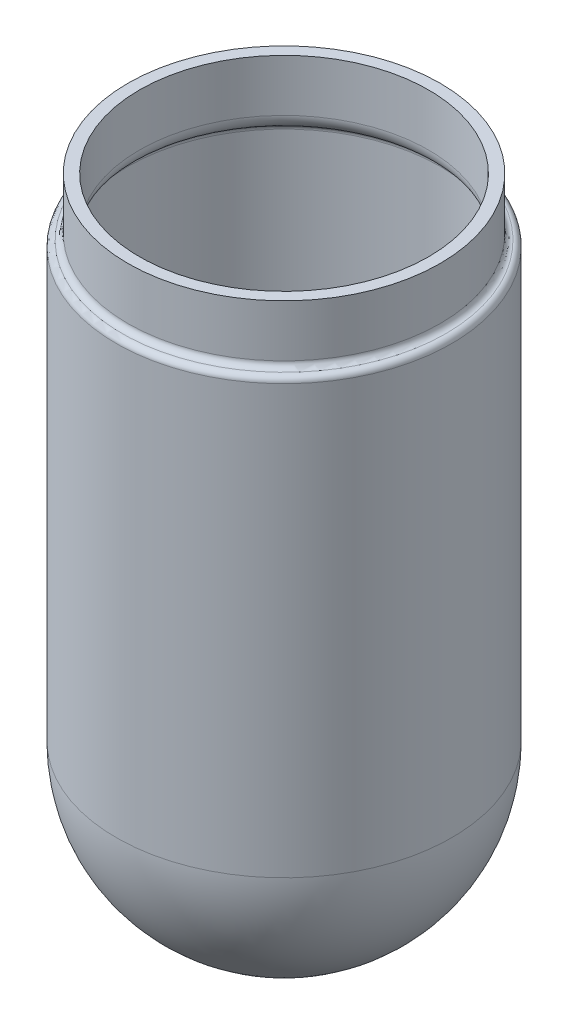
ISO-10303-21;
HEADER;
FILE_DESCRIPTION(('STEP AP214'),'2;1');
FILE_NAME('part.step','',(''),(''),'','','');
FILE_SCHEMA(('AUTOMOTIVE_DESIGN { 1 0 10303 214 1 1 1 1 }'));
ENDSEC;
DATA;
#1=APPLICATION_CONTEXT('core data for automotive mechanical design processes');
#2=APPLICATION_PROTOCOL_DEFINITION('international standard','automotive_design',2000,#1);
#3=PRODUCT_CONTEXT('',#1,'mechanical');
#4=PRODUCT('Part','Part','',(#3));
#5=PRODUCT_RELATED_PRODUCT_CATEGORY('part','',(#4));
#6=PRODUCT_DEFINITION_FORMATION('','',#4);
#7=PRODUCT_DEFINITION_CONTEXT('part definition',#1,'design');
#8=PRODUCT_DEFINITION('design','',#6,#7);
#9=PRODUCT_DEFINITION_SHAPE('','',#8);
#10=(LENGTH_UNIT() NAMED_UNIT(*) SI_UNIT(.MILLI.,.METRE.));
#11=(NAMED_UNIT(*) PLANE_ANGLE_UNIT() SI_UNIT($,.RADIAN.));
#12=(NAMED_UNIT(*) SI_UNIT($,.STERADIAN.) SOLID_ANGLE_UNIT());
#13=UNCERTAINTY_MEASURE_WITH_UNIT(LENGTH_MEASURE(1.E-05),#10,'distance_accuracy_value','');
#14=(GEOMETRIC_REPRESENTATION_CONTEXT(3) GLOBAL_UNCERTAINTY_ASSIGNED_CONTEXT((#13)) GLOBAL_UNIT_ASSIGNED_CONTEXT((#10,
#11,#12)) REPRESENTATION_CONTEXT('',''));
#15=CARTESIAN_POINT('',(0.,0.,0.));
#16=DIRECTION('',(0.,0.,1.));
#17=DIRECTION('',(1.,0.,0.));
#18=AXIS2_PLACEMENT_3D('',#15,#16,#17);
#19=CARTESIAN_POINT('',(0.,-49.2125,0.));
#20=DIRECTION('',(0.,1.,0.));
#21=DIRECTION('',(-1.,0.,0.));
#22=AXIS2_PLACEMENT_3D('',#19,#20,#21);
#23=PLANE('',#22);
#24=CARTESIAN_POINT('',(0.,-49.2125,0.));
#25=DIRECTION('',(0.,1.,0.));
#26=DIRECTION('',(-1.,0.,0.));
#27=AXIS2_PLACEMENT_3D('',#24,#25,#26);
#28=CIRCLE('',#27,39.6875);
#29=CARTESIAN_POINT('',(-39.6875,-49.2125,0.));
#30=VERTEX_POINT('',#29);
#31=EDGE_CURVE('E53',#30,#30,#28,.T.);
#32=ORIENTED_EDGE('',*,*,#31,.F.);
#33=EDGE_LOOP('',(#32));
#34=FACE_BOUND('',#33,.T.);
#35=CARTESIAN_POINT('',(0.,-49.2125,0.));
#36=DIRECTION('',(0.,1.,0.));
#37=DIRECTION('',(-1.,0.,0.));
#38=AXIS2_PLACEMENT_3D('',#35,#36,#37);
#39=CIRCLE('',#38,42.8625);
#40=CARTESIAN_POINT('',(-42.8625,-49.2125,0.));
#41=VERTEX_POINT('',#40);
#42=EDGE_CURVE('E43',#41,#41,#39,.T.);
#43=ORIENTED_EDGE('',*,*,#42,.T.);
#44=EDGE_LOOP('',(#43));
#45=FACE_BOUND('',#44,.T.);
#46=ADVANCED_FACE('F24',(#34,#45),#23,.T.);
#47=CARTESIAN_POINT('',(0.,0.,0.));
#48=DIRECTION('',(0.,1.,0.));
#49=DIRECTION('',(-1.,0.,0.));
#50=AXIS2_PLACEMENT_3D('',#47,#48,#49);
#51=CYLINDRICAL_SURFACE('',#50,42.8625);
#52=CARTESIAN_POINT('',(0.,-63.5,0.));
#53=DIRECTION('',(0.,1.,0.));
#54=DIRECTION('',(-1.,0.,0.));
#55=AXIS2_PLACEMENT_3D('',#52,#53,#54);
#56=CIRCLE('',#55,42.8625);
#57=CARTESIAN_POINT('',(-42.8625,-63.5,0.));
#58=VERTEX_POINT('',#57);
#59=EDGE_CURVE('E38',#58,#58,#56,.T.);
#60=ORIENTED_EDGE('',*,*,#59,.T.);
#61=EDGE_LOOP('',(#60));
#62=FACE_BOUND('',#61,.T.);
#63=ORIENTED_EDGE('',*,*,#42,.F.);
#64=EDGE_LOOP('',(#63));
#65=FACE_BOUND('',#64,.T.);
#66=ADVANCED_FACE('F74',(#62,#65),#51,.T.);
#67=CARTESIAN_POINT('',(0.,0.,0.));
#68=DIRECTION('',(0.,1.,0.));
#69=DIRECTION('',(-1.,0.,0.));
#70=AXIS2_PLACEMENT_3D('',#67,#68,#69);
#71=CYLINDRICAL_SURFACE('',#70,46.0375);
#72=CARTESIAN_POINT('',(0.,-66.675,0.));
#73=DIRECTION('',(0.,1.,0.));
#74=DIRECTION('',(-1.,0.,0.));
#75=AXIS2_PLACEMENT_3D('',#72,#73,#74);
#76=CIRCLE('',#75,46.0375);
#77=CARTESIAN_POINT('',(-46.0375,-66.675,0.));
#78=VERTEX_POINT('',#77);
#79=EDGE_CURVE('E34',#78,#78,#76,.F.);
#80=ORIENTED_EDGE('',*,*,#79,.T.);
#81=EDGE_LOOP('',(#80));
#82=FACE_BOUND('',#81,.T.);
#83=CARTESIAN_POINT('',(0.,-184.15,0.));
#84=DIRECTION('',(0.,1.,0.));
#85=DIRECTION('',(-1.,0.,0.));
#86=AXIS2_PLACEMENT_3D('',#83,#84,#85);
#87=CIRCLE('',#86,46.0375);
#88=CARTESIAN_POINT('',(-46.0375,-184.15,0.));
#89=VERTEX_POINT('',#88);
#90=EDGE_CURVE('E46',#89,#89,#87,.T.);
#91=ORIENTED_EDGE('',*,*,#90,.T.);
#92=EDGE_LOOP('',(#91));
#93=FACE_BOUND('',#92,.T.);
#94=ADVANCED_FACE('F78',(#82,#93),#71,.T.);
#95=CARTESIAN_POINT('',(0.,-184.15,0.));
#96=DIRECTION('',(0.,1.,0.));
#97=DIRECTION('',(-1.,0.,0.));
#98=AXIS2_PLACEMENT_3D('',#95,#96,#97);
#99=SPHERICAL_SURFACE('',#98,46.0375);
#100=ORIENTED_EDGE('',*,*,#90,.F.);
#101=EDGE_LOOP('',(#100));
#102=FACE_BOUND('',#101,.T.);
#103=ADVANCED_FACE('F84',(#102),#99,.T.);
#104=CARTESIAN_POINT('',(0.,-66.675,0.));
#105=DIRECTION('',(0.,1.,0.));
#106=DIRECTION('',(-1.,0.,0.));
#107=AXIS2_PLACEMENT_3D('',#104,#105,#106);
#108=TOROIDAL_SURFACE('',#107,44.45,1.5875);
#109=ORIENTED_EDGE('',*,*,#79,.F.);
#110=EDGE_LOOP('',(#109));
#111=FACE_BOUND('',#110,.T.);
#112=CARTESIAN_POINT('',(0.,-65.0875,0.));
#113=DIRECTION('',(0.,1.,0.));
#114=DIRECTION('',(-1.,0.,0.));
#115=AXIS2_PLACEMENT_3D('',#112,#113,#114);
#116=CIRCLE('',#115,44.45);
#117=CARTESIAN_POINT('',(-44.45,-65.0875,0.));
#118=VERTEX_POINT('',#117);
#119=EDGE_CURVE('E49',#118,#118,#116,.T.);
#120=ORIENTED_EDGE('',*,*,#119,.F.);
#121=EDGE_LOOP('',(#120));
#122=FACE_BOUND('',#121,.T.);
#123=ADVANCED_FACE('F89',(#111,#122),#108,.T.);
#124=CARTESIAN_POINT('',(0.,-63.5,0.));
#125=DIRECTION('',(0.,1.,0.));
#126=DIRECTION('',(-1.,0.,0.));
#127=AXIS2_PLACEMENT_3D('',#124,#125,#126);
#128=TOROIDAL_SURFACE('',#127,44.45,1.5875);
#129=ORIENTED_EDGE('',*,*,#119,.T.);
#130=EDGE_LOOP('',(#129));
#131=FACE_BOUND('',#130,.T.);
#132=ORIENTED_EDGE('',*,*,#59,.F.);
#133=EDGE_LOOP('',(#132));
#134=FACE_BOUND('',#133,.T.);
#135=ADVANCED_FACE('F68',(#131,#134),#128,.F.);
#136=CARTESIAN_POINT('',(0.,0.,0.));
#137=DIRECTION('',(0.,1.,0.));
#138=DIRECTION('',(-1.,0.,0.));
#139=AXIS2_PLACEMENT_3D('',#136,#137,#138);
#140=CYLINDRICAL_SURFACE('',#139,39.6875);
#141=CARTESIAN_POINT('',(0.,-63.5,0.));
#142=DIRECTION('',(0.,1.,0.));
#143=DIRECTION('',(-1.,0.,0.));
#144=AXIS2_PLACEMENT_3D('',#141,#142,#143);
#145=CIRCLE('',#144,39.6875);
#146=CARTESIAN_POINT('',(-39.6875,-63.5,0.));
#147=VERTEX_POINT('',#146);
#148=EDGE_CURVE('E52',#147,#147,#145,.T.);
#149=ORIENTED_EDGE('',*,*,#148,.F.);
#150=EDGE_LOOP('',(#149));
#151=FACE_BOUND('',#150,.T.);
#152=ORIENTED_EDGE('',*,*,#31,.T.);
#153=EDGE_LOOP('',(#152));
#154=FACE_BOUND('',#153,.T.);
#155=ADVANCED_FACE('F64',(#151,#154),#140,.F.);
#156=CARTESIAN_POINT('',(0.,0.,0.));
#157=DIRECTION('',(0.,1.,0.));
#158=DIRECTION('',(-1.,0.,0.));
#159=AXIS2_PLACEMENT_3D('',#156,#157,#158);
#160=CYLINDRICAL_SURFACE('',#159,42.8625);
#161=CARTESIAN_POINT('',(0.,-68.9992613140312,0.));
#162=DIRECTION('',(0.,1.,0.));
#163=DIRECTION('',(-1.,0.,0.));
#164=AXIS2_PLACEMENT_3D('',#161,#162,#163);
#165=CIRCLE('',#164,42.8625);
#166=CARTESIAN_POINT('',(-42.8625,-68.9992613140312,0.));
#167=VERTEX_POINT('',#166);
#168=EDGE_CURVE('E30',#167,#167,#165,.T.);
#169=ORIENTED_EDGE('',*,*,#168,.T.);
#170=EDGE_LOOP('',(#169));
#171=FACE_BOUND('',#170,.T.);
#172=CARTESIAN_POINT('',(0.,-184.15,0.));
#173=DIRECTION('',(0.,1.,0.));
#174=DIRECTION('',(-1.,0.,0.));
#175=AXIS2_PLACEMENT_3D('',#172,#173,#174);
#176=CIRCLE('',#175,42.8625);
#177=CARTESIAN_POINT('',(-42.8625,-184.15,0.));
#178=VERTEX_POINT('',#177);
#179=EDGE_CURVE('E56',#178,#178,#176,.T.);
#180=ORIENTED_EDGE('',*,*,#179,.F.);
#181=EDGE_LOOP('',(#180));
#182=FACE_BOUND('',#181,.T.);
#183=ADVANCED_FACE('F67',(#171,#182),#160,.F.);
#184=CARTESIAN_POINT('',(0.,-184.15,0.));
#185=DIRECTION('',(0.,1.,0.));
#186=DIRECTION('',(-1.,0.,0.));
#187=AXIS2_PLACEMENT_3D('',#184,#185,#186);
#188=SPHERICAL_SURFACE('',#187,42.8625);
#189=ORIENTED_EDGE('',*,*,#179,.T.);
#190=EDGE_LOOP('',(#189));
#191=FACE_BOUND('',#190,.T.);
#192=ADVANCED_FACE('F100',(#191),#188,.F.);
#193=CARTESIAN_POINT('',(0.,-63.5,0.));
#194=DIRECTION('',(0.,1.,0.));
#195=DIRECTION('',(-1.,0.,0.));
#196=AXIS2_PLACEMENT_3D('',#193,#194,#195);
#197=TOROIDAL_SURFACE('',#196,44.45,4.7625);
#198=CARTESIAN_POINT('',(0.,-67.6244459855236,0.));
#199=DIRECTION('',(0.,1.,0.));
#200=DIRECTION('',(-1.,0.,0.));
#201=AXIS2_PLACEMENT_3D('',#198,#199,#200);
#202=CIRCLE('',#201,42.0687499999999);
#203=CARTESIAN_POINT('',(-42.0687499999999,-67.6244459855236,0.));
#204=VERTEX_POINT('',#203);
#205=EDGE_CURVE('E10',#204,#204,#202,.F.);
#206=ORIENTED_EDGE('',*,*,#205,.T.);
#207=EDGE_LOOP('',(#206));
#208=FACE_BOUND('',#207,.T.);
#209=ORIENTED_EDGE('',*,*,#148,.T.);
#210=EDGE_LOOP('',(#209));
#211=FACE_BOUND('',#210,.T.);
#212=ADVANCED_FACE('F62',(#208,#211),#197,.T.);
#213=CARTESIAN_POINT('',(0.,-68.9992613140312,0.));
#214=DIRECTION('',(0.,1.,0.));
#215=DIRECTION('',(-1.,0.,0.));
#216=AXIS2_PLACEMENT_3D('',#213,#214,#215);
#217=TOROIDAL_SURFACE('',#216,41.275,1.5875);
#218=ORIENTED_EDGE('',*,*,#205,.F.);
#219=EDGE_LOOP('',(#218));
#220=FACE_BOUND('',#219,.T.);
#221=ORIENTED_EDGE('',*,*,#168,.F.);
#222=EDGE_LOOP('',(#221));
#223=FACE_BOUND('',#222,.T.);
#224=ADVANCED_FACE('F99',(#220,#223),#217,.F.);
#225=CLOSED_SHELL('',(#46,#66,#94,#103,#123,#135,#155,#183,#192,#212,#224));
#226=MANIFOLD_SOLID_BREP('B2',#225);
#227=ADVANCED_BREP_SHAPE_REPRESENTATION('',(#18,#226),#14);
#228=SHAPE_DEFINITION_REPRESENTATION(#9,#227);
ENDSEC;
END-ISO-10303-21;
